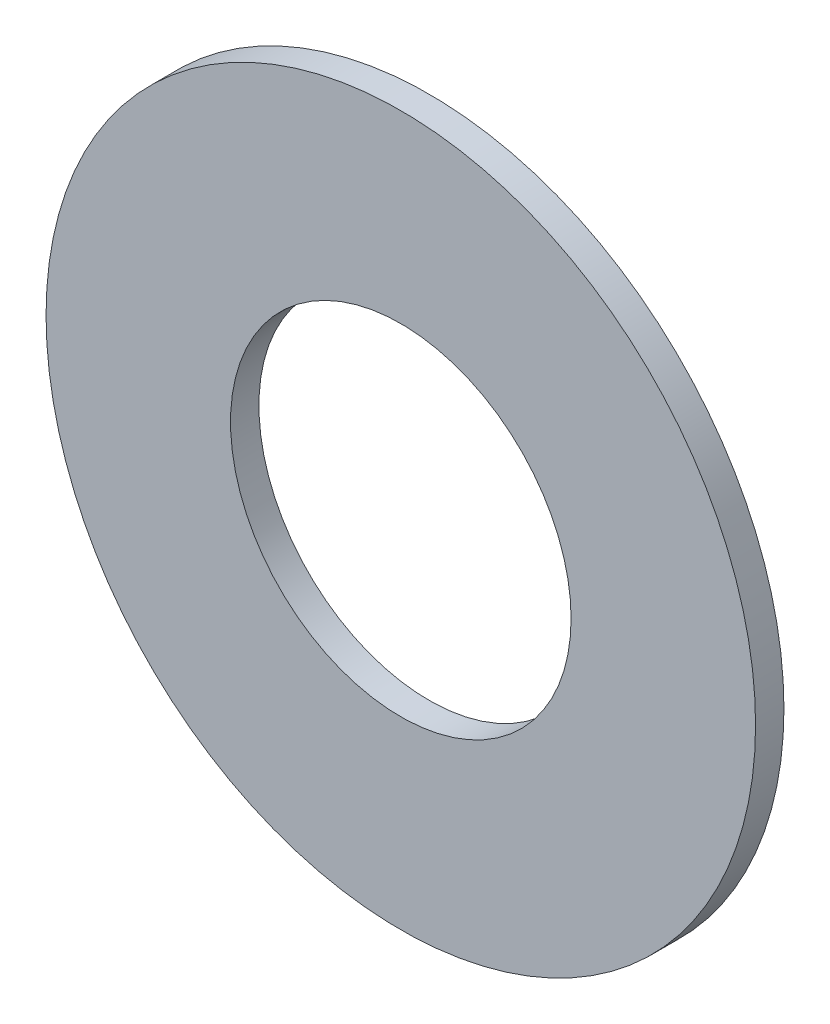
from build123d import *

# Parameters (mm, degrees)
ESQUISSE1_R      = 125
ESQUISSE1_R_2    = 60
EXTRUSION1_DEPTH = 10


with BuildPart() as part:
    # Esquisse1 → Extrusion1 (new body)
    with BuildSketch(Plane.XY):
        Circle(ESQUISSE1_R)
        Circle(ESQUISSE1_R_2, mode=Mode.SUBTRACT)
    extrude(amount=EXTRUSION1_DEPTH)


solid = part.part
